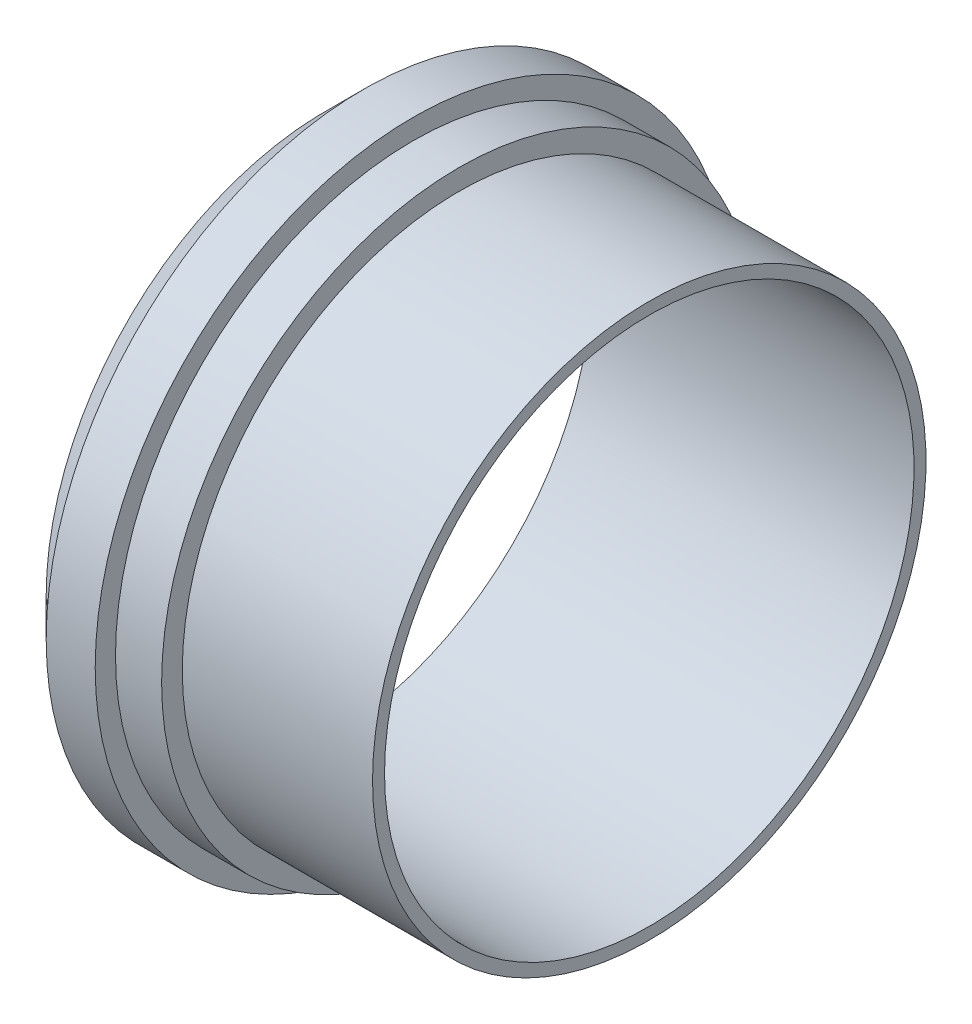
from build123d import *

# Parameters (mm, degrees)
SKETCH4_R          = 36.449
CUT_EXTRUDE1_DEPTH = 44.45


with BuildPart() as part:
    # Sketch1 → Revolve1 (revolve)
    with BuildSketch(Plane.XY, mode=Mode.PRIVATE) as revolve1_sk:
        Polygon((0, 0), (-26.19248, 0), (-26.19248, -2.8448), (-32.54248, -2.8448), (-32.54248, -5.6388), (-39.29126, -5.6388), (-44.45, -0.4826), (-44.45, 38.1), (0, 38.1), align=None)
    revolve(revolve1_sk.sketch.rotate(Axis((-44.45, 38.1, 0), (1, 0, 0)), 270), axis=Axis((-44.45, 38.1, 0), (1, 0, 0)))

    # Sketch4 → Cut-Extrude1 (cut)
    with BuildSketch(Plane.ZY.offset(44.45)):
        with Locations((0, 38.1)):
            Circle(SKETCH4_R)
    extrude(amount=-CUT_EXTRUDE1_DEPTH, mode=Mode.SUBTRACT)


solid = part.part
